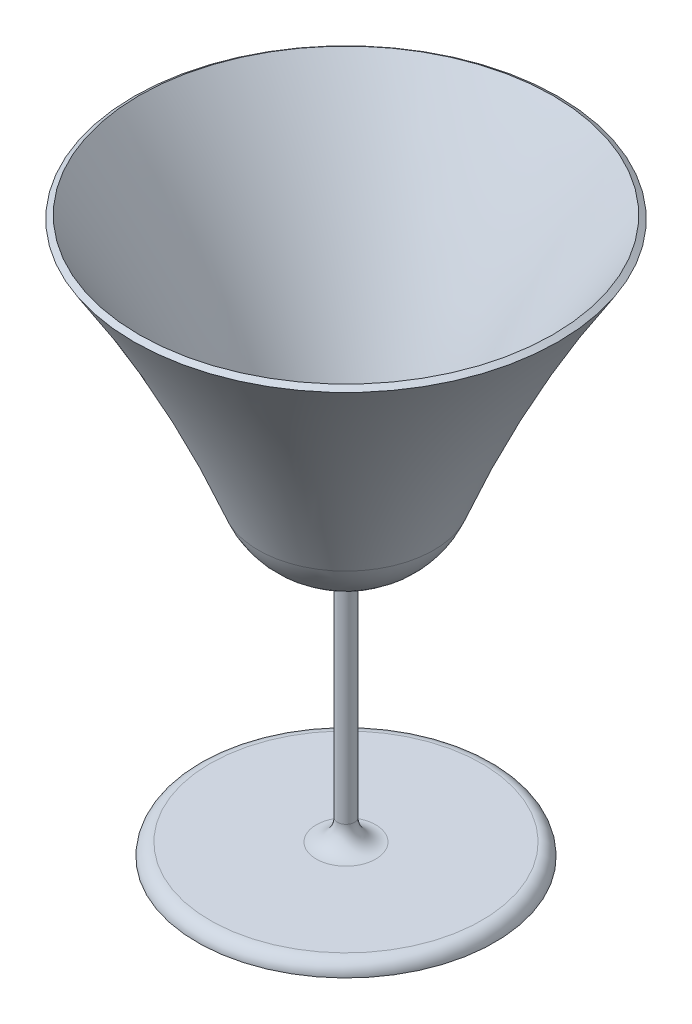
from build123d import *


with BuildPart() as part:
    # Sketch1 → Revolve1 (revolve)
    with BuildSketch(Plane.XY):
        with BuildLine():
            Line((-2, 8), (-2, 60))
            Line((-2, 60), (0, 60))
            Line((0, 60), (0, 0))
            Line((0, 0), (-35, 0))
            ThreePointArc((-35, 0), (-34.121320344, 2.121320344), (-32, 3))
            Line((-32, 3), (-7, 3))
            ThreePointArc((-7, 3), (-3.464466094, 4.464466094), (-2, 8))
        make_face()
        with BuildLine():
            Line((-1.5, 8), (-1.5, 59.5))
            Line((-1.5, 59.5), (-0.5, 59.5))
            Line((-0.5, 59.5), (-0.5, 0.5))
            Line((-0.5, 0.5), (-34.449489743, 0.5))
            ThreePointArc((-34.449489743, 0.5), (-33.58113883, 1.936491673), (-32, 2.5))
            Line((-32, 2.5), (-7, 2.5))
            ThreePointArc((-7, 2.5), (-3.110912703, 4.110912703), (-1.5, 8))
        make_face(mode=Mode.SUBTRACT)
    revolve(axis=Axis((0, 60, 0), (0, -1, 0)))


with BuildPart() as body_2:
    # Sketch2 → Revolve-Thin1 (revolve)
    with BuildSketch(Plane.XY, mode=Mode.PRIVATE) as revolve_thin1_sk:
        with BuildLine():
            ThreePointArc((-2, 60), (-13.326549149, 63.516393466), (-20.670237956, 72.829071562))
            ThreePointArc((-20.670237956, 72.829071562), (-33.800064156, 102.202047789), (-50, 130))
            Line((-50, 130), (-48.746380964, 130.823674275))
            ThreePointArc((-48.746380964, 130.823674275), (-32.465445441, 102.886732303), (-19.269970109, 73.366891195))
            ThreePointArc((-19.269970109, 73.366891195), (-12.477057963, 64.752663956), (-2, 61.5))
            Line((-2, 61.5), (-2, 60))
        make_face()
    revolve(revolve_thin1_sk.sketch.rotate(Axis((0, 86.658590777, 0), (0, 1, 0)), 270), axis=Axis((0, 86.658590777, 0), (0, 1, 0)))


solid = Compound([part.part, body_2.part])
